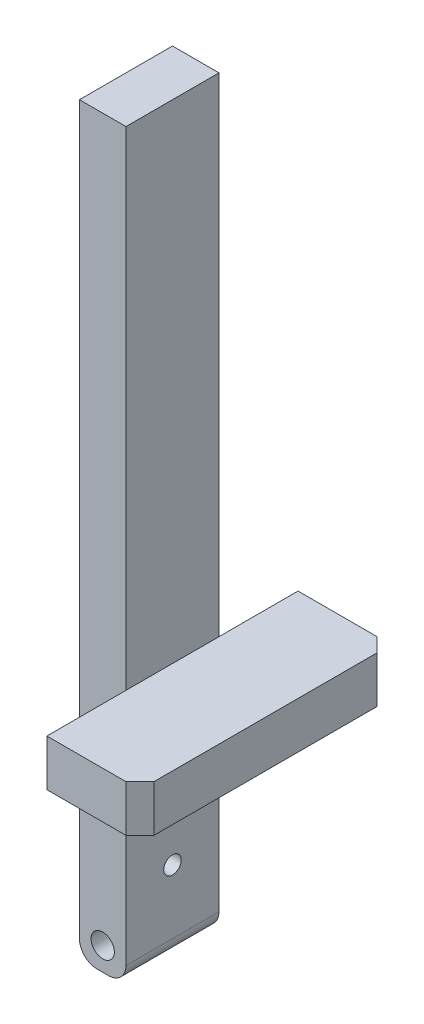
from build123d import *

# Parameters (mm, degrees)
SKETCH2_W               = 12.7
SKETCH2_H               = 203.2
SKETCH2_R               = 3.175
BOSS_EXTRUDE1_DEPTH     = 12.7
SKETCH3_W               = 25.4
SKETCH3_H               = 12.7
BOSS_EXTRUDE2_DEPTH     = 34.29
CUT_EXTRUDE2_DEPTH      = 17.78
CUT_EXTRUDE2_DEPTH_BACK = 15.24
SKETCH6_R               = 2.3876
CHAMFER1_SIZE           = 3.81
FILLET1_R               = 4.7752
SKETCH8_R               = 2.3876
CUT_EXTRUDE3_DEPTH      = 12.7


with BuildPart() as part:
    # Sketch2 → Boss-Extrude1 (new, symmetric)
    with BuildSketch(Plane.XY):
        with Locations((0, 95.25)):
            Rectangle(SKETCH2_W, SKETCH2_H)
        Circle(SKETCH2_R, mode=Mode.SUBTRACT)
    extrude(amount=BOSS_EXTRUDE1_DEPTH, both=True)


with BuildPart() as body_2:
    # Sketch3 → Boss-Extrude2 (new, symmetric)
    with BuildSketch(Plane.XY):
        with Locations((19.05, 57.15)):
            Rectangle(SKETCH3_W, SKETCH3_H)
    extrude(amount=BOSS_EXTRUDE2_DEPTH, both=True)


with BuildPart() as cut_extrude2_tool:
    # Sketch6 → Cut-Extrude2 (new, two sides: drawn at the far end of the back side and taken through both)
    with BuildSketch(Plane(origin=(0, 0, 0), x_dir=(0, 0, -1), z_dir=(1, 0, 0)).offset(-CUT_EXTRUDE2_DEPTH_BACK)):
        with Locations(Location((-6.35, 57.15, 0), (0, 0, 90))):
            Circle(SKETCH6_R)
        with Locations(Location((6.35, 57.15, 0), (0, 0, 90))):
            Circle(SKETCH6_R)
    extrude(amount=CUT_EXTRUDE2_DEPTH + CUT_EXTRUDE2_DEPTH_BACK)


with BuildPart() as part_1:
    add(part.part)

    # Cut-Extrude2: cut by cut_extrude2_tool
    add(cut_extrude2_tool.part, mode=Mode.SUBTRACT)

    # Fillet1
    fillet1_edges = [part_1.edges().sort_by_distance(p)[0] for p in [
        (-6.35, -6.35, 0),
        (6.35, -6.35, 0),
    ]]
    fillet(fillet1_edges, radius=FILLET1_R)

    # Sketch8 → Cut-Extrude3 (cut, symmetric)
    with BuildSketch(Plane(origin=(0, 0, 0), x_dir=(0, 0, -1), z_dir=(1, 0, 0))):
        with Locations(Location((0, 15.875, 0), (0, 0, 90))):
            Circle(SKETCH8_R)
        with Locations(Location((0, 41.275, 0), (0, 0, 90))):
            Circle(SKETCH8_R)
    extrude(amount=CUT_EXTRUDE3_DEPTH, both=True, mode=Mode.SUBTRACT)


with BuildPart() as body_2_1:
    add(body_2.part)

    # Cut-Extrude2: cut by cut_extrude2_tool
    add(cut_extrude2_tool.part, mode=Mode.SUBTRACT)

    # Chamfer1
    chamfer1_edges = [body_2_1.edges().sort_by_distance(p)[0] for p in [
        (31.75, 57.15, 34.29),
        (31.75, 57.15, -34.29),
    ]]
    chamfer(chamfer1_edges, length=CHAMFER1_SIZE)


solid = Compound([part_1.part, body_2_1.part])
